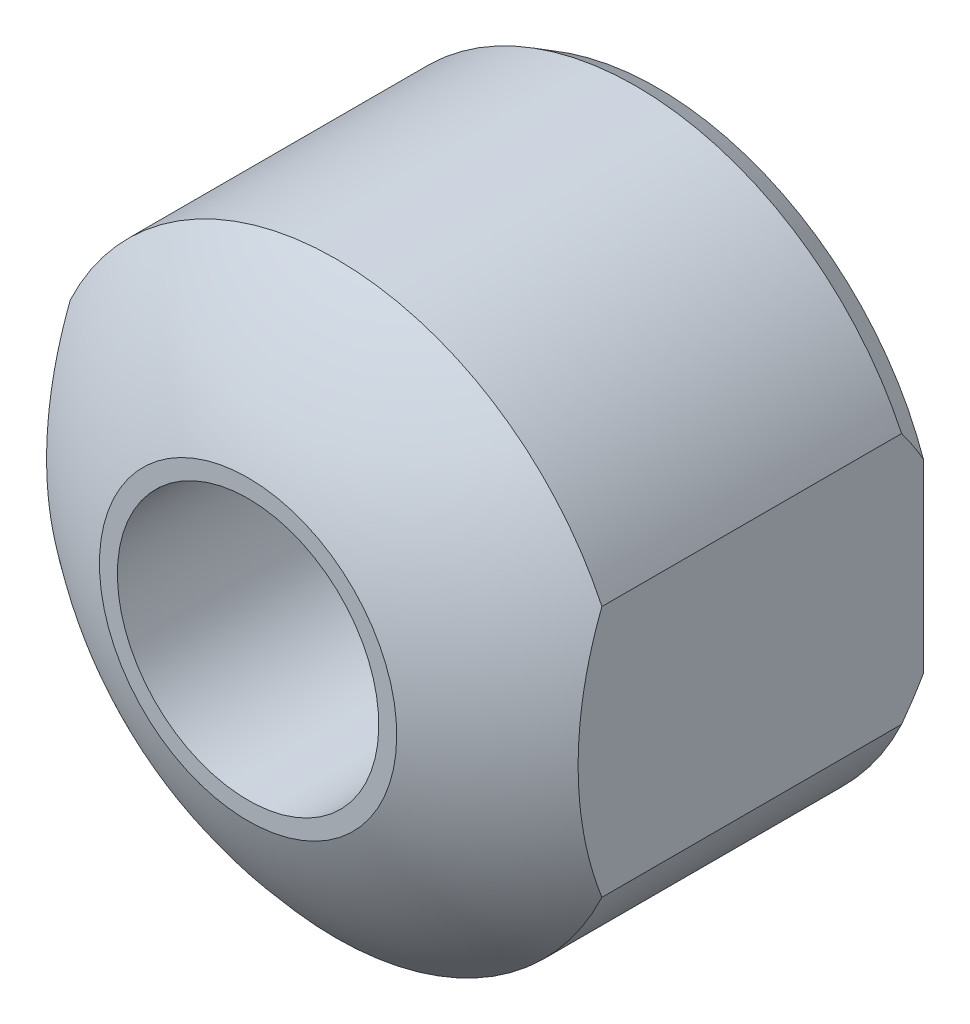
ISO-10303-21;
HEADER;
FILE_DESCRIPTION(('STEP AP214'),'2;1');
FILE_NAME('part.step','',(''),(''),'','','');
FILE_SCHEMA(('AUTOMOTIVE_DESIGN { 1 0 10303 214 1 1 1 1 }'));
ENDSEC;
DATA;
#1=APPLICATION_CONTEXT('core data for automotive mechanical design processes');
#2=APPLICATION_PROTOCOL_DEFINITION('international standard','automotive_design',2000,#1);
#3=PRODUCT_CONTEXT('',#1,'mechanical');
#4=PRODUCT('Part','Part','',(#3));
#5=PRODUCT_RELATED_PRODUCT_CATEGORY('part','',(#4));
#6=PRODUCT_DEFINITION_FORMATION('','',#4);
#7=PRODUCT_DEFINITION_CONTEXT('part definition',#1,'design');
#8=PRODUCT_DEFINITION('design','',#6,#7);
#9=PRODUCT_DEFINITION_SHAPE('','',#8);
#10=(LENGTH_UNIT() NAMED_UNIT(*) SI_UNIT(.MILLI.,.METRE.));
#11=(NAMED_UNIT(*) PLANE_ANGLE_UNIT() SI_UNIT($,.RADIAN.));
#12=(NAMED_UNIT(*) SI_UNIT($,.STERADIAN.) SOLID_ANGLE_UNIT());
#13=UNCERTAINTY_MEASURE_WITH_UNIT(LENGTH_MEASURE(1.E-05),#10,'distance_accuracy_value','');
#14=(GEOMETRIC_REPRESENTATION_CONTEXT(3) GLOBAL_UNCERTAINTY_ASSIGNED_CONTEXT((#13)) GLOBAL_UNIT_ASSIGNED_CONTEXT((#10,
#11,#12)) REPRESENTATION_CONTEXT('',''));
#15=CARTESIAN_POINT('',(0.,0.,0.));
#16=DIRECTION('',(0.,0.,1.));
#17=DIRECTION('',(1.,0.,0.));
#18=AXIS2_PLACEMENT_3D('',#15,#16,#17);
#19=CARTESIAN_POINT('',(6.28837260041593E-13,0.,-1.20216336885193E-12));
#20=DIRECTION('',(0.,0.,1.));
#21=DIRECTION('',(-1.,0.,0.));
#22=AXIS2_PLACEMENT_3D('',#19,#20,#21);
#23=SPHERICAL_SURFACE('',#22,10.0000000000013);
#24=CARTESIAN_POINT('',(0.,0.,9.4));
#25=DIRECTION('',(0.,0.,1.));
#26=DIRECTION('',(0.,1.,0.));
#27=AXIS2_PLACEMENT_3D('',#24,#25,#26);
#28=CIRCLE('',#27,3.4117444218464);
#29=CARTESIAN_POINT('',(0.,3.4117444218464,9.4));
#30=VERTEX_POINT('',#29);
#31=EDGE_CURVE('E9',#30,#30,#28,.T.);
#32=ORIENTED_EDGE('',*,*,#31,.F.);
#33=EDGE_LOOP('',(#32));
#34=FACE_BOUND('',#33,.T.);
#35=CARTESIAN_POINT('',(6.1,0.,-1.20216336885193E-12));
#36=DIRECTION('',(-1.,0.,0.));
#37=DIRECTION('',(0.,-1.,0.));
#38=AXIS2_PLACEMENT_3D('',#35,#36,#37);
#39=CIRCLE('',#38,7.9240141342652);
#40=CARTESIAN_POINT('',(6.1,2.89006920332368,7.3781772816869));
#41=VERTEX_POINT('',#40);
#42=CARTESIAN_POINT('',(6.1,-2.89006920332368,7.3781772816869));
#43=VERTEX_POINT('',#42);
#44=EDGE_CURVE('E104',#41,#43,#39,.F.);
#45=ORIENTED_EDGE('',*,*,#44,.F.);
#46=CARTESIAN_POINT('',(0.,0.,7.3781772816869));
#47=DIRECTION('',(0.,0.,1.));
#48=DIRECTION('',(0.,1.,0.));
#49=AXIS2_PLACEMENT_3D('',#46,#47,#48);
#50=CIRCLE('',#49,6.75);
#51=CARTESIAN_POINT('',(-6.1,2.89006920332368,7.3781772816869));
#52=VERTEX_POINT('',#51);
#53=EDGE_CURVE('E99',#41,#52,#50,.T.);
#54=ORIENTED_EDGE('',*,*,#53,.T.);
#55=CARTESIAN_POINT('',(-6.1,0.,-1.20216336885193E-12));
#56=DIRECTION('',(1.,0.,0.));
#57=DIRECTION('',(0.,1.,0.));
#58=AXIS2_PLACEMENT_3D('',#55,#56,#57);
#59=CIRCLE('',#58,7.92401413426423);
#60=CARTESIAN_POINT('',(-6.1,-2.89006920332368,7.3781772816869));
#61=VERTEX_POINT('',#60);
#62=EDGE_CURVE('E92',#61,#52,#59,.F.);
#63=ORIENTED_EDGE('',*,*,#62,.F.);
#64=EDGE_CURVE('E22',#61,#43,#50,.T.);
#65=ORIENTED_EDGE('',*,*,#64,.T.);
#66=EDGE_LOOP('',(#45,#54,#63,#65));
#67=FACE_BOUND('',#66,.T.);
#68=ADVANCED_FACE('F14',(#34,#67),#23,.T.);
#69=CARTESIAN_POINT('',(0.,0.,0.));
#70=DIRECTION('',(0.,0.,1.));
#71=DIRECTION('',(0.,1.,0.));
#72=AXIS2_PLACEMENT_3D('',#69,#70,#71);
#73=CYLINDRICAL_SURFACE('',#72,6.75);
#74=ORIENTED_EDGE('',*,*,#53,.F.);
#75=DIRECTION('',(0.,0.,1.));
#76=VECTOR('',#75,1.);
#77=CARTESIAN_POINT('',(6.1,2.89006920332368,0.));
#78=LINE('',#77,#76);
#79=CARTESIAN_POINT('',(6.1,2.89006920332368,0.5));
#80=VERTEX_POINT('',#79);
#81=EDGE_CURVE('E77',#41,#80,#78,.F.);
#82=ORIENTED_EDGE('',*,*,#81,.T.);
#83=CARTESIAN_POINT('',(0.,0.,0.5));
#84=DIRECTION('',(0.,0.,1.));
#85=DIRECTION('',(0.,1.,0.));
#86=AXIS2_PLACEMENT_3D('',#83,#84,#85);
#87=CIRCLE('',#86,6.75);
#88=CARTESIAN_POINT('',(-6.1,2.89006920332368,0.5));
#89=VERTEX_POINT('',#88);
#90=EDGE_CURVE('E85',#80,#89,#87,.T.);
#91=ORIENTED_EDGE('',*,*,#90,.T.);
#92=DIRECTION('',(0.,0.,1.));
#93=VECTOR('',#92,1.);
#94=CARTESIAN_POINT('',(-6.1,2.89006920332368,0.));
#95=LINE('',#94,#93);
#96=EDGE_CURVE('E109',#89,#52,#95,.T.);
#97=ORIENTED_EDGE('',*,*,#96,.T.);
#98=EDGE_LOOP('',(#74,#82,#91,#97));
#99=FACE_BOUND('',#98,.T.);
#100=ADVANCED_FACE('F110',(#99),#73,.T.);
#101=CARTESIAN_POINT('',(0.,0.,0.5));
#102=DIRECTION('',(0.,0.,1.));
#103=DIRECTION('',(0.,1.,0.));
#104=AXIS2_PLACEMENT_3D('',#101,#102,#103);
#105=CONICAL_SURFACE('',#104,6.75,0.523598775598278);
#106=ORIENTED_EDGE('',*,*,#90,.F.);
#107=CARTESIAN_POINT('',(6.1,6.7457549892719,4.56129591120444));
#108=CARTESIAN_POINT('',(6.1,6.59600104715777,4.36896022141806));
#109=CARTESIAN_POINT('',(6.1,6.44489016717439,4.1776631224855));
#110=CARTESIAN_POINT('',(6.1,6.13933110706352,3.79764621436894));
#111=CARTESIAN_POINT('',(6.1,5.98488178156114,3.60892732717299));
#112=CARTESIAN_POINT('',(6.1,5.66989753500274,3.23203536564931));
#113=CARTESIAN_POINT('',(6.1,5.5093072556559,3.04390839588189));
#114=CARTESIAN_POINT('',(6.1,5.18339599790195,2.67183463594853));
#115=CARTESIAN_POINT('',(6.1,5.01807573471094,2.48788722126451));
#116=CARTESIAN_POINT('',(6.1,4.66899691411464,2.11160286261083));
#117=CARTESIAN_POINT('',(6.1,4.48478858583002,1.9196809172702));
#118=CARTESIAN_POINT('',(6.1,4.10805487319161,1.54392645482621));
#119=CARTESIAN_POINT('',(6.1,3.91552558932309,1.36009781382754));
#120=CARTESIAN_POINT('',(6.1,3.52142274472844,1.0048343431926));
#121=CARTESIAN_POINT('',(6.1,3.31991213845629,0.833330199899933));
#122=CARTESIAN_POINT('',(6.1,2.90443359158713,0.506282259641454));
#123=CARTESIAN_POINT('',(6.1,2.69048143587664,0.350718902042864));
#124=CARTESIAN_POINT('',(6.1,2.3655731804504,0.139607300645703));
#125=CARTESIAN_POINT('',(6.1,2.26052343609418,0.0749563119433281));
#126=CARTESIAN_POINT('',(6.1,2.04683582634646,-0.0482684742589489));
#127=CARTESIAN_POINT('',(6.1,1.93819662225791,-0.106839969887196));
#128=CARTESIAN_POINT('',(6.1,1.71806811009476,-0.216271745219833));
#129=CARTESIAN_POINT('',(6.1,1.60660547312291,-0.267185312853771));
#130=CARTESIAN_POINT('',(6.1,1.38014316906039,-0.360455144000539));
#131=CARTESIAN_POINT('',(6.1,1.26514425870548,-0.402813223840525));
#132=CARTESIAN_POINT('',(6.1,1.04906853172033,-0.472062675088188));
#133=CARTESIAN_POINT('',(6.1,0.948428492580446,-0.500312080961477));
#134=CARTESIAN_POINT('',(6.1,0.745210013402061,-0.548709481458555));
#135=CARTESIAN_POINT('',(6.1,0.642631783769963,-0.568858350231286));
#136=CARTESIAN_POINT('',(6.1,0.436174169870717,-0.600353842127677));
#137=CARTESIAN_POINT('',(6.1,0.332295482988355,-0.611704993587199));
#138=CARTESIAN_POINT('',(6.1,0.1239350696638,-0.625190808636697));
#139=CARTESIAN_POINT('',(6.1,0.019453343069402,-0.62732546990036));
#140=CARTESIAN_POINT('',(6.1,-0.1893500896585,-0.622291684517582));
#141=CARTESIAN_POINT('',(6.1,-0.293671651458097,-0.615117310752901));
#142=CARTESIAN_POINT('',(6.1,-0.501288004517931,-0.591736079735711));
#143=CARTESIAN_POINT('',(6.1,-0.604582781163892,-0.575529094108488));
#144=CARTESIAN_POINT('',(6.1,-0.809582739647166,-0.534648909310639));
#145=CARTESIAN_POINT('',(6.1,-0.911286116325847,-0.50996673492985));
#146=CARTESIAN_POINT('',(6.1,-1.11255204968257,-0.452920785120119));
#147=CARTESIAN_POINT('',(6.1,-1.21211335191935,-0.420552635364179));
#148=CARTESIAN_POINT('',(6.1,-1.46085038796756,-0.330063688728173));
#149=CARTESIAN_POINT('',(6.1,-1.60837216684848,-0.267383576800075));
#150=CARTESIAN_POINT('',(6.1,-1.89722848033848,-0.129222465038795));
#151=CARTESIAN_POINT('',(6.1,-2.0385610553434,-0.053737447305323));
#152=CARTESIAN_POINT('',(6.1,-2.31593692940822,0.107739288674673));
#153=CARTESIAN_POINT('',(6.1,-2.45195190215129,0.193779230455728));
#154=CARTESIAN_POINT('',(6.1,-2.71844663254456,0.373895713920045));
#155=CARTESIAN_POINT('',(6.1,-2.84892774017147,0.467970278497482));
#156=CARTESIAN_POINT('',(6.1,-3.16836896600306,0.710619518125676));
#157=CARTESIAN_POINT('',(6.1,-3.35433189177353,0.863135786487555));
#158=CARTESIAN_POINT('',(6.1,-3.62543350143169,1.09862756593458));
#159=CARTESIAN_POINT('',(6.1,-3.71398904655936,1.17775366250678));
#160=CARTESIAN_POINT('',(6.1,-3.88909023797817,1.33816368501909));
#161=CARTESIAN_POINT('',(6.1,-3.97563631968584,1.4194471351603));
#162=CARTESIAN_POINT('',(6.1,-4.06129591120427,1.50166195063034));
#163=B_SPLINE_CURVE_WITH_KNOTS('',3,(#107,#108,#109,#110,#111,#112,#113,#114,#115,#116,#117,
#118,#119,#120,#121,#122,#123,#124,#125,#126,#127,#128,#129,#130,#131,#132,#133,#134,#135,#136,
#137,#138,#139,#140,#141,#142,#143,#144,#145,#146,#147,#148,#149,#150,#151,#152,#153,#154,#155,
#156,#157,#158,#159,#160,#161,#162),.UNSPECIFIED.,.F.,.F.,(4,2,2,2,2,2,2,2,2,2,2,2,2,2,2,2,2,2,
2,2,2,2,2,2,2,2,2,4),(0.,0.731297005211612,1.46284902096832,2.20482627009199,2.94669191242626,
3.74456312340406,4.54281238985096,5.33614891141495,6.12849998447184,6.49838988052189,
6.86841932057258,7.23574121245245,7.60298503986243,7.91627517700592,8.22953149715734,
8.54262647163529,8.85572152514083,9.16901602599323,9.48231497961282,9.79594674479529,
10.1097574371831,10.5897914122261,11.0699762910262,11.552443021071,12.0347913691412,
12.7557189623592,13.1119644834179,13.4681320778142),.UNSPECIFIED.);
#164=CARTESIAN_POINT('',(6.1,2.1304269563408,0.));
#165=VERTEX_POINT('',#164);
#166=EDGE_CURVE('E69',#80,#165,#163,.T.);
#167=ORIENTED_EDGE('',*,*,#166,.T.);
#168=CARTESIAN_POINT('',(0.,0.,0.));
#169=DIRECTION('',(0.,0.,1.));
#170=DIRECTION('',(0.,1.,0.));
#171=AXIS2_PLACEMENT_3D('',#168,#169,#170);
#172=CIRCLE('',#171,6.4613248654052);
#173=CARTESIAN_POINT('',(-6.1,2.13042695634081,0.));
#174=VERTEX_POINT('',#173);
#175=EDGE_CURVE('E83',#165,#174,#172,.T.);
#176=ORIENTED_EDGE('',*,*,#175,.T.);
#177=CARTESIAN_POINT('',(-6.1,-4.06129591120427,1.50166195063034));
#178=CARTESIAN_POINT('',(-6.1,-3.98103320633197,1.42462646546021));
#179=CARTESIAN_POINT('',(-6.1,-3.8999893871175,1.34840677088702));
#180=CARTESIAN_POINT('',(-6.1,-3.73614515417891,1.19783935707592));
#181=CARTESIAN_POINT('',(-6.1,-3.6533443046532,1.1234921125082));
#182=CARTESIAN_POINT('',(-6.1,-3.40121673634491,0.902926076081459));
#183=CARTESIAN_POINT('',(-6.1,-3.22898446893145,0.759978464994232));
#184=CARTESIAN_POINT('',(-6.1,-2.87012551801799,0.481843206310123));
#185=CARTESIAN_POINT('',(-6.1,-2.68322481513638,0.347006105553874));
#186=CARTESIAN_POINT('',(-6.1,-2.29820293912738,0.0949408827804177));
#187=CARTESIAN_POINT('',(-6.1,-2.10010825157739,-0.0223265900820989));
#188=CARTESIAN_POINT('',(-6.1,-1.79529398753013,-0.178998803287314));
#189=CARTESIAN_POINT('',(-6.1,-1.69332576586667,-0.227676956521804));
#190=CARTESIAN_POINT('',(-6.1,-1.48631987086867,-0.318103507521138));
#191=CARTESIAN_POINT('',(-6.1,-1.38128192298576,-0.359851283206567));
#192=CARTESIAN_POINT('',(-6.1,-1.16906940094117,-0.435040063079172));
#193=CARTESIAN_POINT('',(-6.1,-1.06191464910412,-0.468536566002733));
#194=CARTESIAN_POINT('',(-6.1,-0.845197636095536,-0.526507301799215));
#195=CARTESIAN_POINT('',(-6.1,-0.735636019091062,-0.550983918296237));
#196=CARTESIAN_POINT('',(-6.1,-0.513197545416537,-0.590262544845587));
#197=CARTESIAN_POINT('',(-6.1,-0.400295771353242,-0.60492519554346));
#198=CARTESIAN_POINT('',(-6.1,-0.173603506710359,-0.623373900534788));
#199=CARTESIAN_POINT('',(-6.1,-0.0598130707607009,-0.627160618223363));
#200=CARTESIAN_POINT('',(-6.1,0.167693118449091,-0.623679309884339));
#201=CARTESIAN_POINT('',(-6.1,0.281408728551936,-0.616401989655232));
#202=CARTESIAN_POINT('',(-6.1,0.507636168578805,-0.591115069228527));
#203=CARTESIAN_POINT('',(-6.1,0.6201478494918,-0.573104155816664));
#204=CARTESIAN_POINT('',(-6.1,0.856714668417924,-0.524309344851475));
#205=CARTESIAN_POINT('',(-6.1,0.980502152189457,-0.49223451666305));
#206=CARTESIAN_POINT('',(-6.1,1.22467848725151,-0.417015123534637));
#207=CARTESIAN_POINT('',(-6.1,1.34506576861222,-0.373865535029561));
#208=CARTESIAN_POINT('',(-6.1,1.58228365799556,-0.278009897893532));
#209=CARTESIAN_POINT('',(-6.1,1.69910467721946,-0.225280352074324));
#210=CARTESIAN_POINT('',(-6.1,1.92878819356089,-0.111888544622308));
#211=CARTESIAN_POINT('',(-6.1,2.04165083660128,-0.051226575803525));
#212=CARTESIAN_POINT('',(-6.1,2.28375593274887,0.0883162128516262));
#213=CARTESIAN_POINT('',(-6.1,2.41224172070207,0.168503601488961));
#214=CARTESIAN_POINT('',(-6.1,2.66433323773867,0.336248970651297));
#215=CARTESIAN_POINT('',(-6.1,2.78793706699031,0.42380977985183));
#216=CARTESIAN_POINT('',(-6.1,3.03089935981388,0.604966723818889));
#217=CARTESIAN_POINT('',(-6.1,3.15025130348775,0.698571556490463));
#218=CARTESIAN_POINT('',(-6.1,3.38503074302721,0.890595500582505));
#219=CARTESIAN_POINT('',(-6.1,3.50045750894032,0.989015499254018));
#220=CARTESIAN_POINT('',(-6.1,3.84308154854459,1.29148463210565));
#221=CARTESIAN_POINT('',(-6.1,4.06500787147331,1.50150434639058));
#222=CARTESIAN_POINT('',(-6.1,4.49777928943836,1.9321606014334));
#223=CARTESIAN_POINT('',(-6.1,4.70863322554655,2.15278839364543));
#224=CARTESIAN_POINT('',(-6.1,5.07745656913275,2.55361929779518));
#225=CARTESIAN_POINT('',(-6.1,5.2370588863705,2.7323288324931));
#226=CARTESIAN_POINT('',(-6.1,5.55190643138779,3.09358887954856));
#227=CARTESIAN_POINT('',(-6.1,5.70715092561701,3.27614002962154));
#228=CARTESIAN_POINT('',(-6.1,6.01132961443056,3.6411459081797));
#229=CARTESIAN_POINT('',(-6.1,6.16032635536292,3.82354868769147));
#230=CARTESIAN_POINT('',(-6.1,6.45522258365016,4.19074263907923));
#231=CARTESIAN_POINT('',(-6.1,6.60112309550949,4.3755329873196));
#232=CARTESIAN_POINT('',(-6.1,6.74575498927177,4.56129591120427));
#233=B_SPLINE_CURVE_WITH_KNOTS('',3,(#177,#178,#179,#180,#181,#182,#183,#184,#185,#186,#187,
#188,#189,#190,#191,#192,#193,#194,#195,#196,#197,#198,#199,#200,#201,#202,#203,#204,#205,#206,
#207,#208,#209,#210,#211,#212,#213,#214,#215,#216,#217,#218,#219,#220,#221,#222,#223,#224,#225,
#226,#227,#228,#229,#230,#231,#232),.UNSPECIFIED.,.F.,.F.,(4,2,2,2,2,2,2,2,2,2,2,2,2,2,2,2,2,2,
2,2,2,2,2,2,2,2,2,4),(0.,0.333737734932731,0.667559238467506,1.33862492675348,2.02937199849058,
2.71854809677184,3.05731690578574,3.39611610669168,3.7325701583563,4.06893523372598,
4.40998075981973,4.75100548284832,5.0923168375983,5.43366995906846,5.81669672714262,
6.19989754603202,6.58405126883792,6.96819081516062,7.42223331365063,7.87645079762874,
8.33133717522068,8.78630768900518,9.7023388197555,10.6176270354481,11.336357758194,
12.0552087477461,12.7617419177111,13.46803753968),.UNSPECIFIED.);
#234=EDGE_CURVE('E111',#174,#89,#233,.T.);
#235=ORIENTED_EDGE('',*,*,#234,.T.);
#236=EDGE_LOOP('',(#106,#167,#176,#235));
#237=FACE_BOUND('',#236,.T.);
#238=ADVANCED_FACE('F81',(#237),#105,.T.);
#239=CARTESIAN_POINT('',(-6.4613248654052,0.,0.));
#240=DIRECTION('',(0.,0.,-1.));
#241=DIRECTION('',(0.,-1.,0.));
#242=AXIS2_PLACEMENT_3D('',#239,#240,#241);
#243=PLANE('',#242);
#244=CARTESIAN_POINT('',(0.,0.,0.));
#245=DIRECTION('',(0.,0.,1.));
#246=DIRECTION('',(0.,1.,0.));
#247=AXIS2_PLACEMENT_3D('',#244,#245,#246);
#248=CIRCLE('',#247,3.);
#249=CARTESIAN_POINT('',(0.,3.,0.));
#250=VERTEX_POINT('',#249);
#251=EDGE_CURVE('E162',#250,#250,#248,.T.);
#252=ORIENTED_EDGE('',*,*,#251,.T.);
#253=EDGE_LOOP('',(#252));
#254=FACE_BOUND('',#253,.T.);
#255=ORIENTED_EDGE('',*,*,#175,.F.);
#256=DIRECTION('',(0.,1.,0.));
#257=VECTOR('',#256,1.);
#258=CARTESIAN_POINT('',(6.1,-6.75,0.));
#259=LINE('',#258,#257);
#260=CARTESIAN_POINT('',(6.1,-2.1304269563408,0.));
#261=VERTEX_POINT('',#260);
#262=EDGE_CURVE('E65',#261,#165,#259,.T.);
#263=ORIENTED_EDGE('',*,*,#262,.F.);
#264=CARTESIAN_POINT('',(-6.1,-2.13042695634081,0.));
#265=VERTEX_POINT('',#264);
#266=EDGE_CURVE('E91',#265,#261,#172,.T.);
#267=ORIENTED_EDGE('',*,*,#266,.F.);
#268=DIRECTION('',(0.,1.,0.));
#269=VECTOR('',#268,1.);
#270=CARTESIAN_POINT('',(-6.1,-6.75,0.));
#271=LINE('',#270,#269);
#272=EDGE_CURVE('E89',#265,#174,#271,.T.);
#273=ORIENTED_EDGE('',*,*,#272,.T.);
#274=EDGE_LOOP('',(#255,#263,#267,#273));
#275=FACE_BOUND('',#274,.T.);
#276=ADVANCED_FACE('F88',(#254,#275),#243,.T.);
#277=DIRECTION('',(0.,0.,1.));
#278=VECTOR('',#277,1.);
#279=CARTESIAN_POINT('',(6.1,-2.89006920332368,0.));
#280=LINE('',#279,#278);
#281=CARTESIAN_POINT('',(6.1,-2.89006920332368,0.5));
#282=VERTEX_POINT('',#281);
#283=EDGE_CURVE('E182',#43,#282,#280,.F.);
#284=ORIENTED_EDGE('',*,*,#283,.F.);
#285=ORIENTED_EDGE('',*,*,#64,.F.);
#286=DIRECTION('',(0.,0.,1.));
#287=VECTOR('',#286,1.);
#288=CARTESIAN_POINT('',(-6.1,-2.89006920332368,0.));
#289=LINE('',#288,#287);
#290=CARTESIAN_POINT('',(-6.1,-2.89006920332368,0.5));
#291=VERTEX_POINT('',#290);
#292=EDGE_CURVE('E29',#291,#61,#289,.T.);
#293=ORIENTED_EDGE('',*,*,#292,.F.);
#294=EDGE_CURVE('E97',#291,#282,#87,.T.);
#295=ORIENTED_EDGE('',*,*,#294,.T.);
#296=EDGE_LOOP('',(#284,#285,#293,#295));
#297=FACE_BOUND('',#296,.T.);
#298=ADVANCED_FACE('F136',(#297),#73,.T.);
#299=CARTESIAN_POINT('',(6.1,-6.7457549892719,4.56129591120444));
#300=CARTESIAN_POINT('',(6.1,-6.59600104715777,4.36896022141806));
#301=CARTESIAN_POINT('',(6.1,-6.44489016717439,4.1776631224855));
#302=CARTESIAN_POINT('',(6.1,-6.13933110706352,3.79764621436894));
#303=CARTESIAN_POINT('',(6.1,-5.98488178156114,3.60892732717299));
#304=CARTESIAN_POINT('',(6.1,-5.66989753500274,3.23203536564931));
#305=CARTESIAN_POINT('',(6.1,-5.5093072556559,3.04390839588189));
#306=CARTESIAN_POINT('',(6.1,-5.18339599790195,2.67183463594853));
#307=CARTESIAN_POINT('',(6.1,-5.01807573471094,2.48788722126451));
#308=CARTESIAN_POINT('',(6.1,-4.66899691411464,2.11160286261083));
#309=CARTESIAN_POINT('',(6.1,-4.48478858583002,1.9196809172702));
#310=CARTESIAN_POINT('',(6.1,-4.10805487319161,1.54392645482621));
#311=CARTESIAN_POINT('',(6.1,-3.91552558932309,1.36009781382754));
#312=CARTESIAN_POINT('',(6.1,-3.52142274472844,1.0048343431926));
#313=CARTESIAN_POINT('',(6.1,-3.31991213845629,0.833330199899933));
#314=CARTESIAN_POINT('',(6.1,-2.90443359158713,0.506282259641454));
#315=CARTESIAN_POINT('',(6.1,-2.69048143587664,0.350718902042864));
#316=CARTESIAN_POINT('',(6.1,-2.3655731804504,0.139607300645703));
#317=CARTESIAN_POINT('',(6.1,-2.26052343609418,0.0749563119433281));
#318=CARTESIAN_POINT('',(6.1,-2.04683582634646,-0.0482684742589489));
#319=CARTESIAN_POINT('',(6.1,-1.93819662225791,-0.106839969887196));
#320=CARTESIAN_POINT('',(6.1,-1.71806811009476,-0.216271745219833));
#321=CARTESIAN_POINT('',(6.1,-1.60660547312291,-0.267185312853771));
#322=CARTESIAN_POINT('',(6.1,-1.38014316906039,-0.360455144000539));
#323=CARTESIAN_POINT('',(6.1,-1.26514425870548,-0.402813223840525));
#324=CARTESIAN_POINT('',(6.1,-1.04906853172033,-0.472062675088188));
#325=CARTESIAN_POINT('',(6.1,-0.948428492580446,-0.500312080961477));
#326=CARTESIAN_POINT('',(6.1,-0.745210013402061,-0.548709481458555));
#327=CARTESIAN_POINT('',(6.1,-0.642631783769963,-0.568858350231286));
#328=CARTESIAN_POINT('',(6.1,-0.436174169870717,-0.600353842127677));
#329=CARTESIAN_POINT('',(6.1,-0.332295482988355,-0.611704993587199));
#330=CARTESIAN_POINT('',(6.1,-0.1239350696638,-0.625190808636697));
#331=CARTESIAN_POINT('',(6.1,-0.019453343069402,-0.62732546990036));
#332=CARTESIAN_POINT('',(6.1,0.1893500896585,-0.622291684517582));
#333=CARTESIAN_POINT('',(6.1,0.293671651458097,-0.615117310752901));
#334=CARTESIAN_POINT('',(6.1,0.501288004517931,-0.591736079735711));
#335=CARTESIAN_POINT('',(6.1,0.604582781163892,-0.575529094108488));
#336=CARTESIAN_POINT('',(6.1,0.809582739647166,-0.534648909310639));
#337=CARTESIAN_POINT('',(6.1,0.911286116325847,-0.50996673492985));
#338=CARTESIAN_POINT('',(6.1,1.11255204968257,-0.452920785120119));
#339=CARTESIAN_POINT('',(6.1,1.21211335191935,-0.420552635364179));
#340=CARTESIAN_POINT('',(6.1,1.46085038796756,-0.330063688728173));
#341=CARTESIAN_POINT('',(6.1,1.60837216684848,-0.267383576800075));
#342=CARTESIAN_POINT('',(6.1,1.89722848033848,-0.129222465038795));
#343=CARTESIAN_POINT('',(6.1,2.0385610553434,-0.053737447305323));
#344=CARTESIAN_POINT('',(6.1,2.31593692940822,0.107739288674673));
#345=CARTESIAN_POINT('',(6.1,2.45195190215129,0.193779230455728));
#346=CARTESIAN_POINT('',(6.1,2.71844663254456,0.373895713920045));
#347=CARTESIAN_POINT('',(6.1,2.84892774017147,0.467970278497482));
#348=CARTESIAN_POINT('',(6.1,3.16836896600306,0.710619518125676));
#349=CARTESIAN_POINT('',(6.1,3.35433189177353,0.863135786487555));
#350=CARTESIAN_POINT('',(6.1,3.62543350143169,1.09862756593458));
#351=CARTESIAN_POINT('',(6.1,3.71398904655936,1.17775366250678));
#352=CARTESIAN_POINT('',(6.1,3.88909023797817,1.33816368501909));
#353=CARTESIAN_POINT('',(6.1,3.97563631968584,1.4194471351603));
#354=CARTESIAN_POINT('',(6.1,4.06129591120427,1.50166195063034));
#355=B_SPLINE_CURVE_WITH_KNOTS('',3,(#299,#300,#301,#302,#303,#304,#305,#306,#307,#308,#309,
#310,#311,#312,#313,#314,#315,#316,#317,#318,#319,#320,#321,#322,#323,#324,#325,#326,#327,#328,
#329,#330,#331,#332,#333,#334,#335,#336,#337,#338,#339,#340,#341,#342,#343,#344,#345,#346,#347,
#348,#349,#350,#351,#352,#353,#354),.UNSPECIFIED.,.F.,.F.,(4,2,2,2,2,2,2,2,2,2,2,2,2,2,2,2,2,2,
2,2,2,2,2,2,2,2,2,4),(0.,0.731297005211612,1.46284902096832,2.20482627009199,2.94669191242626,
3.74456312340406,4.54281238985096,5.33614891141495,6.12849998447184,6.49838988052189,
6.86841932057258,7.23574121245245,7.60298503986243,7.91627517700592,8.22953149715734,
8.54262647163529,8.85572152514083,9.16901602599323,9.48231497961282,9.79594674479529,
10.1097574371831,10.5897914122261,11.0699762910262,11.552443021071,12.0347913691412,
12.7557189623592,13.1119644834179,13.4681320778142),.UNSPECIFIED.);
#356=EDGE_CURVE('E72',#282,#261,#355,.T.);
#357=ORIENTED_EDGE('',*,*,#356,.F.);
#358=ORIENTED_EDGE('',*,*,#294,.F.);
#359=CARTESIAN_POINT('',(-6.1,4.06129591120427,1.50166195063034));
#360=CARTESIAN_POINT('',(-6.1,3.98103320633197,1.42462646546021));
#361=CARTESIAN_POINT('',(-6.1,3.8999893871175,1.34840677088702));
#362=CARTESIAN_POINT('',(-6.1,3.73614515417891,1.19783935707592));
#363=CARTESIAN_POINT('',(-6.1,3.6533443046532,1.1234921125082));
#364=CARTESIAN_POINT('',(-6.1,3.40121673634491,0.902926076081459));
#365=CARTESIAN_POINT('',(-6.1,3.22898446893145,0.759978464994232));
#366=CARTESIAN_POINT('',(-6.1,2.87012551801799,0.481843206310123));
#367=CARTESIAN_POINT('',(-6.1,2.68322481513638,0.347006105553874));
#368=CARTESIAN_POINT('',(-6.1,2.29820293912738,0.0949408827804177));
#369=CARTESIAN_POINT('',(-6.1,2.10010825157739,-0.0223265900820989));
#370=CARTESIAN_POINT('',(-6.1,1.79529398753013,-0.178998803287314));
#371=CARTESIAN_POINT('',(-6.1,1.69332576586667,-0.227676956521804));
#372=CARTESIAN_POINT('',(-6.1,1.48631987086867,-0.318103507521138));
#373=CARTESIAN_POINT('',(-6.1,1.38128192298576,-0.359851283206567));
#374=CARTESIAN_POINT('',(-6.1,1.16906940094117,-0.435040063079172));
#375=CARTESIAN_POINT('',(-6.1,1.06191464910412,-0.468536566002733));
#376=CARTESIAN_POINT('',(-6.1,0.845197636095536,-0.526507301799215));
#377=CARTESIAN_POINT('',(-6.1,0.735636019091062,-0.550983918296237));
#378=CARTESIAN_POINT('',(-6.1,0.513197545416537,-0.590262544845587));
#379=CARTESIAN_POINT('',(-6.1,0.400295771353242,-0.60492519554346));
#380=CARTESIAN_POINT('',(-6.1,0.173603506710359,-0.623373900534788));
#381=CARTESIAN_POINT('',(-6.1,0.0598130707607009,-0.627160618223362));
#382=CARTESIAN_POINT('',(-6.1,-0.167693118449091,-0.623679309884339));
#383=CARTESIAN_POINT('',(-6.1,-0.281408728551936,-0.616401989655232));
#384=CARTESIAN_POINT('',(-6.1,-0.507636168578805,-0.591115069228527));
#385=CARTESIAN_POINT('',(-6.1,-0.6201478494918,-0.573104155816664));
#386=CARTESIAN_POINT('',(-6.1,-0.856714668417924,-0.524309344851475));
#387=CARTESIAN_POINT('',(-6.1,-0.980502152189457,-0.49223451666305));
#388=CARTESIAN_POINT('',(-6.1,-1.22467848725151,-0.417015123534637));
#389=CARTESIAN_POINT('',(-6.1,-1.34506576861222,-0.373865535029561));
#390=CARTESIAN_POINT('',(-6.1,-1.58228365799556,-0.278009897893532));
#391=CARTESIAN_POINT('',(-6.1,-1.69910467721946,-0.225280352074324));
#392=CARTESIAN_POINT('',(-6.1,-1.92878819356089,-0.111888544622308));
#393=CARTESIAN_POINT('',(-6.1,-2.04165083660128,-0.0512265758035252));
#394=CARTESIAN_POINT('',(-6.1,-2.28375593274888,0.0883162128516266));
#395=CARTESIAN_POINT('',(-6.1,-2.41224172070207,0.168503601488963));
#396=CARTESIAN_POINT('',(-6.1,-2.66433323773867,0.336248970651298));
#397=CARTESIAN_POINT('',(-6.1,-2.78793706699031,0.42380977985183));
#398=CARTESIAN_POINT('',(-6.1,-3.03089935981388,0.604966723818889));
#399=CARTESIAN_POINT('',(-6.1,-3.15025130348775,0.698571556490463));
#400=CARTESIAN_POINT('',(-6.1,-3.38503074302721,0.890595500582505));
#401=CARTESIAN_POINT('',(-6.1,-3.50045750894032,0.989015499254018));
#402=CARTESIAN_POINT('',(-6.1,-3.84308154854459,1.29148463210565));
#403=CARTESIAN_POINT('',(-6.1,-4.06500787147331,1.50150434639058));
#404=CARTESIAN_POINT('',(-6.1,-4.49777928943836,1.9321606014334));
#405=CARTESIAN_POINT('',(-6.1,-4.70863322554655,2.15278839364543));
#406=CARTESIAN_POINT('',(-6.1,-5.07745656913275,2.55361929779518));
#407=CARTESIAN_POINT('',(-6.1,-5.23705888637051,2.7323288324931));
#408=CARTESIAN_POINT('',(-6.1,-5.5519064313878,3.09358887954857));
#409=CARTESIAN_POINT('',(-6.1,-5.70715092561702,3.27614002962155));
#410=CARTESIAN_POINT('',(-6.1,-6.01132961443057,3.64114590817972));
#411=CARTESIAN_POINT('',(-6.1,-6.16032635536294,3.8235486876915));
#412=CARTESIAN_POINT('',(-6.1,-6.45522258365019,4.19074263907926));
#413=CARTESIAN_POINT('',(-6.1,-6.60112309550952,4.37553298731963));
#414=CARTESIAN_POINT('',(-6.1,-6.7457549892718,4.5612959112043));
#415=B_SPLINE_CURVE_WITH_KNOTS('',3,(#359,#360,#361,#362,#363,#364,#365,#366,#367,#368,#369,
#370,#371,#372,#373,#374,#375,#376,#377,#378,#379,#380,#381,#382,#383,#384,#385,#386,#387,#388,
#389,#390,#391,#392,#393,#394,#395,#396,#397,#398,#399,#400,#401,#402,#403,#404,#405,#406,#407,
#408,#409,#410,#411,#412,#413,#414),.UNSPECIFIED.,.F.,.F.,(4,2,2,2,2,2,2,2,2,2,2,2,2,2,2,2,2,2,
2,2,2,2,2,2,2,2,2,4),(0.,0.333737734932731,0.667559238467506,1.33862492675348,2.02937199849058,
2.71854809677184,3.05731690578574,3.39611610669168,3.7325701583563,4.06893523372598,
4.40998075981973,4.75100548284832,5.0923168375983,5.43366995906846,5.81669672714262,
6.19989754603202,6.58405126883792,6.96819081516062,7.42223331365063,7.87645079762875,
8.33133717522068,8.78630768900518,9.7023388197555,10.6176270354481,11.336357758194,
12.0552087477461,12.7617419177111,13.4680375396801),.UNSPECIFIED.);
#416=EDGE_CURVE('E34',#265,#291,#415,.T.);
#417=ORIENTED_EDGE('',*,*,#416,.F.);
#418=ORIENTED_EDGE('',*,*,#266,.T.);
#419=EDGE_LOOP('',(#357,#358,#417,#418));
#420=FACE_BOUND('',#419,.T.);
#421=ADVANCED_FACE('F143',(#420),#105,.T.);
#422=CARTESIAN_POINT('',(0.,0.,9.4));
#423=DIRECTION('',(0.,0.,1.));
#424=DIRECTION('',(0.,1.,0.));
#425=AXIS2_PLACEMENT_3D('',#422,#423,#424);
#426=PLANE('',#425);
#427=CARTESIAN_POINT('',(0.,0.,9.4));
#428=DIRECTION('',(0.,0.,1.));
#429=DIRECTION('',(0.,1.,0.));
#430=AXIS2_PLACEMENT_3D('',#427,#428,#429);
#431=CIRCLE('',#430,3.);
#432=CARTESIAN_POINT('',(0.,3.,9.4));
#433=VERTEX_POINT('',#432);
#434=EDGE_CURVE('E86',#433,#433,#431,.T.);
#435=ORIENTED_EDGE('',*,*,#434,.F.);
#436=EDGE_LOOP('',(#435));
#437=FACE_BOUND('',#436,.T.);
#438=ORIENTED_EDGE('',*,*,#31,.T.);
#439=EDGE_LOOP('',(#438));
#440=FACE_BOUND('',#439,.T.);
#441=ADVANCED_FACE('F16',(#437,#440),#426,.T.);
#442=CARTESIAN_POINT('',(-6.1,-6.75,9.4));
#443=DIRECTION('',(1.,0.,0.));
#444=DIRECTION('',(0.,1.,0.));
#445=AXIS2_PLACEMENT_3D('',#442,#443,#444);
#446=PLANE('',#445);
#447=ORIENTED_EDGE('',*,*,#62,.T.);
#448=ORIENTED_EDGE('',*,*,#96,.F.);
#449=ORIENTED_EDGE('',*,*,#234,.F.);
#450=ORIENTED_EDGE('',*,*,#272,.F.);
#451=ORIENTED_EDGE('',*,*,#416,.T.);
#452=ORIENTED_EDGE('',*,*,#292,.T.);
#453=EDGE_LOOP('',(#447,#448,#449,#450,#451,#452));
#454=FACE_BOUND('',#453,.T.);
#455=ADVANCED_FACE('F108',(#454),#446,.F.);
#456=CARTESIAN_POINT('',(6.1,-6.75,0.));
#457=DIRECTION('',(-1.,0.,0.));
#458=DIRECTION('',(0.,-1.,0.));
#459=AXIS2_PLACEMENT_3D('',#456,#457,#458);
#460=PLANE('',#459);
#461=ORIENTED_EDGE('',*,*,#44,.T.);
#462=ORIENTED_EDGE('',*,*,#283,.T.);
#463=ORIENTED_EDGE('',*,*,#356,.T.);
#464=ORIENTED_EDGE('',*,*,#262,.T.);
#465=ORIENTED_EDGE('',*,*,#166,.F.);
#466=ORIENTED_EDGE('',*,*,#81,.F.);
#467=EDGE_LOOP('',(#461,#462,#463,#464,#465,#466));
#468=FACE_BOUND('',#467,.T.);
#469=ADVANCED_FACE('F67',(#468),#460,.F.);
#470=CARTESIAN_POINT('',(0.,0.,9.4));
#471=DIRECTION('',(0.,0.,-1.));
#472=DIRECTION('',(0.,-1.,0.));
#473=AXIS2_PLACEMENT_3D('',#470,#471,#472);
#474=CYLINDRICAL_SURFACE('',#473,3.);
#475=ORIENTED_EDGE('',*,*,#434,.T.);
#476=EDGE_LOOP('',(#475));
#477=FACE_BOUND('',#476,.T.);
#478=ORIENTED_EDGE('',*,*,#251,.F.);
#479=EDGE_LOOP('',(#478));
#480=FACE_BOUND('',#479,.T.);
#481=ADVANCED_FACE('F173',(#477,#480),#474,.F.);
#482=CLOSED_SHELL('',(#68,#100,#238,#276,#298,#421,#441,#455,#469,#481));
#483=MANIFOLD_SOLID_BREP('B1',#482);
#484=ADVANCED_BREP_SHAPE_REPRESENTATION('',(#18,#483),#14);
#485=SHAPE_DEFINITION_REPRESENTATION(#9,#484);
ENDSEC;
END-ISO-10303-21;
